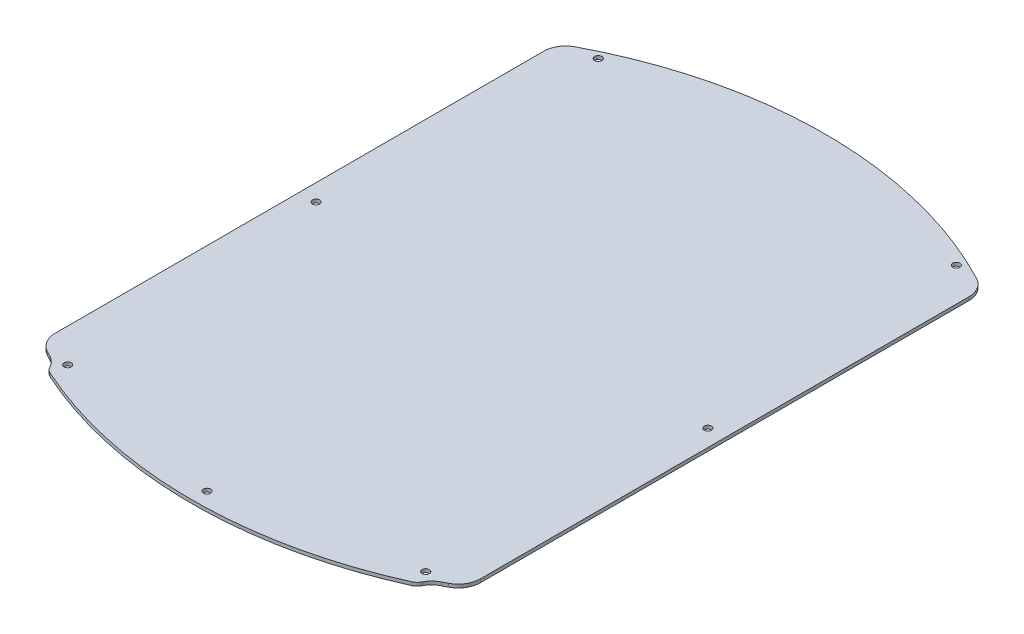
ISO-10303-21;
HEADER;
FILE_DESCRIPTION(('STEP AP214'),'2;1');
FILE_NAME('part.step','',(''),(''),'','','');
FILE_SCHEMA(('AUTOMOTIVE_DESIGN { 1 0 10303 214 1 1 1 1 }'));
ENDSEC;
DATA;
#1=APPLICATION_CONTEXT('core data for automotive mechanical design processes');
#2=APPLICATION_PROTOCOL_DEFINITION('international standard','automotive_design',2000,#1);
#3=PRODUCT_CONTEXT('',#1,'mechanical');
#4=PRODUCT('Part','Part','',(#3));
#5=PRODUCT_RELATED_PRODUCT_CATEGORY('part','',(#4));
#6=PRODUCT_DEFINITION_FORMATION('','',#4);
#7=PRODUCT_DEFINITION_CONTEXT('part definition',#1,'design');
#8=PRODUCT_DEFINITION('design','',#6,#7);
#9=PRODUCT_DEFINITION_SHAPE('','',#8);
#10=(LENGTH_UNIT() NAMED_UNIT(*) SI_UNIT(.MILLI.,.METRE.));
#11=(NAMED_UNIT(*) PLANE_ANGLE_UNIT() SI_UNIT($,.RADIAN.));
#12=(NAMED_UNIT(*) SI_UNIT($,.STERADIAN.) SOLID_ANGLE_UNIT());
#13=UNCERTAINTY_MEASURE_WITH_UNIT(LENGTH_MEASURE(1.E-05),#10,'distance_accuracy_value','');
#14=(GEOMETRIC_REPRESENTATION_CONTEXT(3) GLOBAL_UNCERTAINTY_ASSIGNED_CONTEXT((#13)) GLOBAL_UNIT_ASSIGNED_CONTEXT((#10,
#11,#12)) REPRESENTATION_CONTEXT('',''));
#15=CARTESIAN_POINT('',(0.,0.,0.));
#16=DIRECTION('',(0.,0.,1.));
#17=DIRECTION('',(1.,0.,0.));
#18=AXIS2_PLACEMENT_3D('',#15,#16,#17);
#19=CARTESIAN_POINT('',(0.,-1.5,-52.9999999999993));
#20=DIRECTION('',(0.,1.,0.));
#21=DIRECTION('',(0.,0.,1.));
#22=AXIS2_PLACEMENT_3D('',#19,#20,#21);
#23=CYLINDRICAL_SURFACE('',#22,193.);
#24=CARTESIAN_POINT('',(0.,-1.5,-52.9999999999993));
#25=DIRECTION('',(0.,1.,0.));
#26=DIRECTION('',(0.,0.,1.));
#27=AXIS2_PLACEMENT_3D('',#24,#25,#26);
#28=CIRCLE('',#27,193.);
#29=CARTESIAN_POINT('',(-89.6448087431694,-1.5,117.917548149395));
#30=VERTEX_POINT('',#29);
#31=CARTESIAN_POINT('',(-87.4520577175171,-1.5,119.049811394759));
#32=VERTEX_POINT('',#31);
#33=EDGE_CURVE('E180',#30,#32,#28,.T.);
#34=ORIENTED_EDGE('',*,*,#33,.T.);
#35=DIRECTION('',(0.,1.,0.));
#36=VECTOR('',#35,1.);
#37=CARTESIAN_POINT('',(-87.4520577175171,-1.5,119.049811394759));
#38=LINE('',#37,#36);
#39=CARTESIAN_POINT('',(-87.4520577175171,0.,119.049811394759));
#40=VERTEX_POINT('',#39);
#41=EDGE_CURVE('E206',#32,#40,#38,.T.);
#42=ORIENTED_EDGE('',*,*,#41,.T.);
#43=CARTESIAN_POINT('',(0.,0.,-52.9999999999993));
#44=DIRECTION('',(0.,1.,0.));
#45=DIRECTION('',(0.,0.,1.));
#46=AXIS2_PLACEMENT_3D('',#43,#44,#45);
#47=CIRCLE('',#46,193.);
#48=CARTESIAN_POINT('',(-89.6448087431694,0.,117.917548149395));
#49=VERTEX_POINT('',#48);
#50=EDGE_CURVE('E267',#49,#40,#47,.T.);
#51=ORIENTED_EDGE('',*,*,#50,.F.);
#52=DIRECTION('',(0.,1.,0.));
#53=VECTOR('',#52,1.);
#54=CARTESIAN_POINT('',(-89.6448087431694,-1.5,117.917548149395));
#55=LINE('',#54,#53);
#56=EDGE_CURVE('E204',#49,#30,#55,.F.);
#57=ORIENTED_EDGE('',*,*,#56,.T.);
#58=EDGE_LOOP('',(#34,#42,#51,#57));
#59=FACE_BOUND('',#58,.T.);
#60=ADVANCED_FACE('F43',(#59),#23,.T.);
#61=CARTESIAN_POINT('',(0.,-1.5,53.0000000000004));
#62=DIRECTION('',(0.,1.,0.));
#63=DIRECTION('',(0.,0.,1.));
#64=AXIS2_PLACEMENT_3D('',#61,#62,#63);
#65=CYLINDRICAL_SURFACE('',#64,193.);
#66=CARTESIAN_POINT('',(0.,-1.5,53.0000000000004));
#67=DIRECTION('',(0.,1.,0.));
#68=DIRECTION('',(0.,0.,-1.));
#69=AXIS2_PLACEMENT_3D('',#66,#67,#68);
#70=CIRCLE('',#69,193.);
#71=CARTESIAN_POINT('',(89.6448087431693,-1.5,-117.917548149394));
#72=VERTEX_POINT('',#71);
#73=CARTESIAN_POINT('',(-89.6448087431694,-1.5,-117.917548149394));
#74=VERTEX_POINT('',#73);
#75=EDGE_CURVE('E262',#72,#74,#70,.T.);
#76=ORIENTED_EDGE('',*,*,#75,.T.);
#77=DIRECTION('',(0.,1.,0.));
#78=VECTOR('',#77,1.);
#79=CARTESIAN_POINT('',(-89.6448087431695,-1.5,-117.917548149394));
#80=LINE('',#79,#78);
#81=CARTESIAN_POINT('',(-89.6448087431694,0.,-117.917548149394));
#82=VERTEX_POINT('',#81);
#83=EDGE_CURVE('E168',#74,#82,#80,.T.);
#84=ORIENTED_EDGE('',*,*,#83,.T.);
#85=CARTESIAN_POINT('',(0.,0.,53.0000000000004));
#86=DIRECTION('',(0.,1.,0.));
#87=DIRECTION('',(0.,0.,-1.));
#88=AXIS2_PLACEMENT_3D('',#85,#86,#87);
#89=CIRCLE('',#88,193.);
#90=CARTESIAN_POINT('',(89.6448087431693,0.,-117.917548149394));
#91=VERTEX_POINT('',#90);
#92=EDGE_CURVE('E151',#91,#82,#89,.T.);
#93=ORIENTED_EDGE('',*,*,#92,.F.);
#94=DIRECTION('',(0.,1.,0.));
#95=VECTOR('',#94,1.);
#96=CARTESIAN_POINT('',(89.6448087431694,-1.5,-117.917548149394));
#97=LINE('',#96,#95);
#98=EDGE_CURVE('E165',#91,#72,#97,.F.);
#99=ORIENTED_EDGE('',*,*,#98,.T.);
#100=EDGE_LOOP('',(#76,#84,#93,#99));
#101=FACE_BOUND('',#100,.T.);
#102=ADVANCED_FACE('F164',(#101),#65,.T.);
#103=CARTESIAN_POINT('',(95.,-1.5,115.));
#104=DIRECTION('',(1.,0.,0.));
#105=DIRECTION('',(0.,0.,-1.));
#106=AXIS2_PLACEMENT_3D('',#103,#104,#105);
#107=PLANE('',#106);
#108=DIRECTION('',(0.,0.,-1.));
#109=VECTOR('',#108,1.);
#110=CARTESIAN_POINT('',(95.,-1.5,115.));
#111=LINE('',#110,#109);
#112=CARTESIAN_POINT('',(95.,-1.5,109.061716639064));
#113=VERTEX_POINT('',#112);
#114=CARTESIAN_POINT('',(95.,-1.5,-109.061716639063));
#115=VERTEX_POINT('',#114);
#116=EDGE_CURVE('E175',#113,#115,#111,.T.);
#117=ORIENTED_EDGE('',*,*,#116,.T.);
#118=DIRECTION('',(0.,1.,0.));
#119=VECTOR('',#118,1.);
#120=CARTESIAN_POINT('',(95.,-1.5,-109.061716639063));
#121=LINE('',#120,#119);
#122=CARTESIAN_POINT('',(95.,0.,-109.061716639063));
#123=VERTEX_POINT('',#122);
#124=EDGE_CURVE('E202',#115,#123,#121,.T.);
#125=ORIENTED_EDGE('',*,*,#124,.T.);
#126=DIRECTION('',(0.,0.,-1.));
#127=VECTOR('',#126,1.);
#128=CARTESIAN_POINT('',(95.,0.,115.));
#129=LINE('',#128,#127);
#130=CARTESIAN_POINT('',(95.,0.,109.061716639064));
#131=VERTEX_POINT('',#130);
#132=EDGE_CURVE('E153',#131,#123,#129,.T.);
#133=ORIENTED_EDGE('',*,*,#132,.F.);
#134=DIRECTION('',(0.,1.,0.));
#135=VECTOR('',#134,1.);
#136=CARTESIAN_POINT('',(95.,-1.5,109.061716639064));
#137=LINE('',#136,#135);
#138=EDGE_CURVE('E200',#131,#113,#137,.F.);
#139=ORIENTED_EDGE('',*,*,#138,.T.);
#140=EDGE_LOOP('',(#117,#125,#133,#139));
#141=FACE_BOUND('',#140,.T.);
#142=ADVANCED_FACE('F346',(#141),#107,.T.);
#143=CARTESIAN_POINT('',(87.4520577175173,0.,119.049811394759));
#144=VERTEX_POINT('',#143);
#145=CARTESIAN_POINT('',(89.6448087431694,0.,117.917548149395));
#146=VERTEX_POINT('',#145);
#147=EDGE_CURVE('E255',#144,#146,#47,.T.);
#148=ORIENTED_EDGE('',*,*,#147,.F.);
#149=DIRECTION('',(0.,1.,0.));
#150=VECTOR('',#149,1.);
#151=CARTESIAN_POINT('',(87.4520577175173,-1.5,119.049811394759));
#152=LINE('',#151,#150);
#153=CARTESIAN_POINT('',(87.4520577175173,-1.5,119.049811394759));
#154=VERTEX_POINT('',#153);
#155=EDGE_CURVE('E212',#144,#154,#152,.F.);
#156=ORIENTED_EDGE('',*,*,#155,.T.);
#157=CARTESIAN_POINT('',(89.6448087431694,-1.5,117.917548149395));
#158=VERTEX_POINT('',#157);
#159=EDGE_CURVE('E253',#154,#158,#28,.T.);
#160=ORIENTED_EDGE('',*,*,#159,.T.);
#161=DIRECTION('',(0.,1.,0.));
#162=VECTOR('',#161,1.);
#163=CARTESIAN_POINT('',(89.6448087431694,-1.5,117.917548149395));
#164=LINE('',#163,#162);
#165=EDGE_CURVE('E209',#158,#146,#164,.T.);
#166=ORIENTED_EDGE('',*,*,#165,.T.);
#167=EDGE_LOOP('',(#148,#156,#160,#166));
#168=FACE_BOUND('',#167,.T.);
#169=ADVANCED_FACE('F252',(#168),#23,.T.);
#170=CARTESIAN_POINT('',(-95.,-1.5,115.));
#171=DIRECTION('',(-1.,0.,0.));
#172=DIRECTION('',(0.,0.,1.));
#173=AXIS2_PLACEMENT_3D('',#170,#171,#172);
#174=PLANE('',#173);
#175=DIRECTION('',(0.,0.,1.));
#176=VECTOR('',#175,1.);
#177=CARTESIAN_POINT('',(-95.,0.,115.));
#178=LINE('',#177,#176);
#179=CARTESIAN_POINT('',(-95.,0.,-109.061716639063));
#180=VERTEX_POINT('',#179);
#181=CARTESIAN_POINT('',(-95.,0.,109.061716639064));
#182=VERTEX_POINT('',#181);
#183=EDGE_CURVE('E169',#180,#182,#178,.T.);
#184=ORIENTED_EDGE('',*,*,#183,.F.);
#185=DIRECTION('',(0.,1.,0.));
#186=VECTOR('',#185,1.);
#187=CARTESIAN_POINT('',(-95.,-1.5,-109.061716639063));
#188=LINE('',#187,#186);
#189=CARTESIAN_POINT('',(-95.,-1.5,-109.061716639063));
#190=VERTEX_POINT('',#189);
#191=EDGE_CURVE('E191',#180,#190,#188,.F.);
#192=ORIENTED_EDGE('',*,*,#191,.T.);
#193=DIRECTION('',(0.,0.,1.));
#194=VECTOR('',#193,1.);
#195=CARTESIAN_POINT('',(-95.,-1.5,115.));
#196=LINE('',#195,#194);
#197=CARTESIAN_POINT('',(-95.,-1.5,109.061716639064));
#198=VERTEX_POINT('',#197);
#199=EDGE_CURVE('E258',#190,#198,#196,.T.);
#200=ORIENTED_EDGE('',*,*,#199,.T.);
#201=DIRECTION('',(0.,1.,0.));
#202=VECTOR('',#201,1.);
#203=CARTESIAN_POINT('',(-95.,-1.5,109.061716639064));
#204=LINE('',#203,#202);
#205=EDGE_CURVE('E188',#198,#182,#204,.T.);
#206=ORIENTED_EDGE('',*,*,#205,.T.);
#207=EDGE_LOOP('',(#184,#192,#200,#206));
#208=FACE_BOUND('',#207,.T.);
#209=ADVANCED_FACE('F351',(#208),#174,.T.);
#210=CARTESIAN_POINT('',(0.,-1.5,53.0000000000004));
#211=DIRECTION('',(0.,-1.,0.));
#212=DIRECTION('',(0.,0.,-1.));
#213=AXIS2_PLACEMENT_3D('',#210,#211,#212);
#214=PLANE('',#213);
#215=CARTESIAN_POINT('',(79.9805060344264,-1.5,118.518748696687));
#216=DIRECTION('',(0.,1.,0.));
#217=DIRECTION('',(0.,0.,1.));
#218=AXIS2_PLACEMENT_3D('',#215,#216,#217);
#219=CIRCLE('',#218,1.60000000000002);
#220=CARTESIAN_POINT('',(79.9805060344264,-1.5,120.118748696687));
#221=VERTEX_POINT('',#220);
#222=EDGE_CURVE('E291',#221,#221,#219,.T.);
#223=ORIENTED_EDGE('',*,*,#222,.T.);
#224=EDGE_LOOP('',(#223));
#225=FACE_BOUND('',#224,.T.);
#226=CARTESIAN_POINT('',(0.,-1.5,136.25));
#227=DIRECTION('',(0.,1.,0.));
#228=DIRECTION('',(0.,0.,1.));
#229=AXIS2_PLACEMENT_3D('',#226,#227,#228);
#230=CIRCLE('',#229,1.60000000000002);
#231=CARTESIAN_POINT('',(0.,-1.5,137.85));
#232=VERTEX_POINT('',#231);
#233=EDGE_CURVE('E298',#232,#232,#230,.T.);
#234=ORIENTED_EDGE('',*,*,#233,.T.);
#235=EDGE_LOOP('',(#234));
#236=FACE_BOUND('',#235,.T.);
#237=CARTESIAN_POINT('',(-79.9805060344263,-1.5,118.518748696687));
#238=DIRECTION('',(0.,1.,0.));
#239=DIRECTION('',(0.,0.,1.));
#240=AXIS2_PLACEMENT_3D('',#237,#238,#239);
#241=CIRCLE('',#240,1.60000000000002);
#242=CARTESIAN_POINT('',(-79.9805060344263,-1.5,120.118748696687));
#243=VERTEX_POINT('',#242);
#244=EDGE_CURVE('E279',#243,#243,#241,.T.);
#245=ORIENTED_EDGE('',*,*,#244,.T.);
#246=EDGE_LOOP('',(#245));
#247=FACE_BOUND('',#246,.T.);
#248=CARTESIAN_POINT('',(79.9805060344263,-1.5,-118.518748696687));
#249=DIRECTION('',(0.,1.,0.));
#250=DIRECTION('',(0.,0.,1.));
#251=AXIS2_PLACEMENT_3D('',#248,#249,#250);
#252=CIRCLE('',#251,1.60000000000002);
#253=CARTESIAN_POINT('',(79.9805060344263,-1.5,-116.918748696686));
#254=VERTEX_POINT('',#253);
#255=EDGE_CURVE('E286',#254,#254,#252,.T.);
#256=ORIENTED_EDGE('',*,*,#255,.T.);
#257=EDGE_LOOP('',(#256));
#258=FACE_BOUND('',#257,.T.);
#259=CARTESIAN_POINT('',(87.5000000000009,-1.5,0.));
#260=DIRECTION('',(0.,1.,0.));
#261=DIRECTION('',(0.,0.,1.));
#262=AXIS2_PLACEMENT_3D('',#259,#260,#261);
#263=CIRCLE('',#262,1.60000000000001);
#264=CARTESIAN_POINT('',(87.5000000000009,-1.5,1.60000000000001));
#265=VERTEX_POINT('',#264);
#266=EDGE_CURVE('E309',#265,#265,#263,.T.);
#267=ORIENTED_EDGE('',*,*,#266,.T.);
#268=EDGE_LOOP('',(#267));
#269=FACE_BOUND('',#268,.T.);
#270=CARTESIAN_POINT('',(-87.5000000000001,-1.5,0.));
#271=DIRECTION('',(0.,1.,0.));
#272=DIRECTION('',(0.,0.,1.));
#273=AXIS2_PLACEMENT_3D('',#270,#271,#272);
#274=CIRCLE('',#273,1.60000000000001);
#275=CARTESIAN_POINT('',(-87.5000000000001,-1.5,1.60000000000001));
#276=VERTEX_POINT('',#275);
#277=EDGE_CURVE('E303',#276,#276,#274,.T.);
#278=ORIENTED_EDGE('',*,*,#277,.T.);
#279=EDGE_LOOP('',(#278));
#280=FACE_BOUND('',#279,.T.);
#281=CARTESIAN_POINT('',(-79.9805060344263,-1.5,-118.518748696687));
#282=DIRECTION('',(0.,1.,0.));
#283=DIRECTION('',(0.,0.,1.));
#284=AXIS2_PLACEMENT_3D('',#281,#282,#283);
#285=CIRCLE('',#284,1.60000000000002);
#286=CARTESIAN_POINT('',(-79.9805060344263,-1.5,-116.918748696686));
#287=VERTEX_POINT('',#286);
#288=EDGE_CURVE('E271',#287,#287,#285,.T.);
#289=ORIENTED_EDGE('',*,*,#288,.T.);
#290=EDGE_LOOP('',(#289));
#291=FACE_BOUND('',#290,.T.);
#292=CARTESIAN_POINT('',(91.9832524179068,-1.5,127.964309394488));
#293=DIRECTION('',(0.,-1.,0.));
#294=DIRECTION('',(0.,0.,-1.));
#295=AXIS2_PLACEMENT_3D('',#292,#293,#294);
#296=CIRCLE('',#295,10.);
#297=CARTESIAN_POINT('',(83.1111833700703,-1.5,123.35059171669));
#298=VERTEX_POINT('',#297);
#299=EDGE_CURVE('E221',#154,#298,#296,.F.);
#300=ORIENTED_EDGE('',*,*,#299,.T.);
#301=CARTESIAN_POINT('',(78.6751488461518,-1.5,121.043732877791));
#302=DIRECTION('',(0.,-1.,0.));
#303=DIRECTION('',(0.,0.,-1.));
#304=AXIS2_PLACEMENT_3D('',#301,#302,#303);
#305=CIRCLE('',#304,5.);
#306=CARTESIAN_POINT('',(80.7347077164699,-1.5,125.599851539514));
#307=VERTEX_POINT('',#306);
#308=EDGE_CURVE('E51',#298,#307,#305,.T.);
#309=ORIENTED_EDGE('',*,*,#308,.T.);
#310=CARTESIAN_POINT('',(0.,-1.5,-52.9999999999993));
#311=DIRECTION('',(0.,1.,0.));
#312=DIRECTION('',(0.,0.,1.));
#313=AXIS2_PLACEMENT_3D('',#310,#311,#312);
#314=CIRCLE('',#313,196.);
#315=CARTESIAN_POINT('',(-80.7347077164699,-1.5,125.599851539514));
#316=VERTEX_POINT('',#315);
#317=EDGE_CURVE('E170',#316,#307,#314,.T.);
#318=ORIENTED_EDGE('',*,*,#317,.F.);
#319=CARTESIAN_POINT('',(-78.6751488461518,-1.5,121.043732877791));
#320=DIRECTION('',(0.,-1.,0.));
#321=DIRECTION('',(0.,0.,-1.));
#322=AXIS2_PLACEMENT_3D('',#319,#320,#321);
#323=CIRCLE('',#322,5.);
#324=CARTESIAN_POINT('',(-83.1111833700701,-1.5,123.35059171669));
#325=VERTEX_POINT('',#324);
#326=EDGE_CURVE('E58',#316,#325,#323,.T.);
#327=ORIENTED_EDGE('',*,*,#326,.T.);
#328=CARTESIAN_POINT('',(-91.9832524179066,-1.5,127.964309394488));
#329=DIRECTION('',(0.,-1.,0.));
#330=DIRECTION('',(0.,0.,-1.));
#331=AXIS2_PLACEMENT_3D('',#328,#329,#330);
#332=CIRCLE('',#331,10.);
#333=EDGE_CURVE('E217',#325,#32,#332,.F.);
#334=ORIENTED_EDGE('',*,*,#333,.T.);
#335=ORIENTED_EDGE('',*,*,#33,.F.);
#336=CARTESIAN_POINT('',(-85.,-1.5,109.061716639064));
#337=DIRECTION('',(0.,-1.,0.));
#338=DIRECTION('',(0.,0.,-1.));
#339=AXIS2_PLACEMENT_3D('',#336,#337,#338);
#340=CIRCLE('',#339,10.);
#341=EDGE_CURVE('E195',#30,#198,#340,.T.);
#342=ORIENTED_EDGE('',*,*,#341,.T.);
#343=ORIENTED_EDGE('',*,*,#199,.F.);
#344=CARTESIAN_POINT('',(-85.,-1.5,-109.061716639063));
#345=DIRECTION('',(0.,-1.,0.));
#346=DIRECTION('',(0.,0.,-1.));
#347=AXIS2_PLACEMENT_3D('',#344,#345,#346);
#348=CIRCLE('',#347,10.);
#349=EDGE_CURVE('E198',#190,#74,#348,.T.);
#350=ORIENTED_EDGE('',*,*,#349,.T.);
#351=ORIENTED_EDGE('',*,*,#75,.F.);
#352=CARTESIAN_POINT('',(85.,-1.5,-109.061716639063));
#353=DIRECTION('',(0.,-1.,0.));
#354=DIRECTION('',(0.,0.,-1.));
#355=AXIS2_PLACEMENT_3D('',#352,#353,#354);
#356=CIRCLE('',#355,10.);
#357=EDGE_CURVE('E174',#72,#115,#356,.T.);
#358=ORIENTED_EDGE('',*,*,#357,.T.);
#359=ORIENTED_EDGE('',*,*,#116,.F.);
#360=CARTESIAN_POINT('',(85.,-1.5,109.061716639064));
#361=DIRECTION('',(0.,-1.,0.));
#362=DIRECTION('',(0.,0.,-1.));
#363=AXIS2_PLACEMENT_3D('',#360,#361,#362);
#364=CIRCLE('',#363,10.);
#365=EDGE_CURVE('E193',#113,#158,#364,.T.);
#366=ORIENTED_EDGE('',*,*,#365,.T.);
#367=ORIENTED_EDGE('',*,*,#159,.F.);
#368=EDGE_LOOP('',(#300,#309,#318,#327,#334,#335,#342,#343,#350,#351,#358,#359,#366,#367));
#369=FACE_BOUND('',#368,.T.);
#370=ADVANCED_FACE('F235',(#225,#236,#247,#258,#269,#280,#291,#369),#214,.T.);
#371=CARTESIAN_POINT('',(0.,0.,53.0000000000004));
#372=DIRECTION('',(0.,-1.,0.));
#373=DIRECTION('',(0.,0.,-1.));
#374=AXIS2_PLACEMENT_3D('',#371,#372,#373);
#375=PLANE('',#374);
#376=CARTESIAN_POINT('',(79.9805060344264,0.,118.518748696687));
#377=DIRECTION('',(0.,1.,0.));
#378=DIRECTION('',(0.,0.,1.));
#379=AXIS2_PLACEMENT_3D('',#376,#377,#378);
#380=CIRCLE('',#379,1.60000000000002);
#381=CARTESIAN_POINT('',(79.9805060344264,0.,120.118748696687));
#382=VERTEX_POINT('',#381);
#383=EDGE_CURVE('E294',#382,#382,#380,.T.);
#384=ORIENTED_EDGE('',*,*,#383,.F.);
#385=EDGE_LOOP('',(#384));
#386=FACE_BOUND('',#385,.T.);
#387=CARTESIAN_POINT('',(0.,0.,136.25));
#388=DIRECTION('',(0.,1.,0.));
#389=DIRECTION('',(0.,0.,1.));
#390=AXIS2_PLACEMENT_3D('',#387,#388,#389);
#391=CIRCLE('',#390,1.60000000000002);
#392=CARTESIAN_POINT('',(0.,0.,137.85));
#393=VERTEX_POINT('',#392);
#394=EDGE_CURVE('E283',#393,#393,#391,.T.);
#395=ORIENTED_EDGE('',*,*,#394,.F.);
#396=EDGE_LOOP('',(#395));
#397=FACE_BOUND('',#396,.T.);
#398=CARTESIAN_POINT('',(-79.9805060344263,0.,118.518748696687));
#399=DIRECTION('',(0.,1.,0.));
#400=DIRECTION('',(0.,0.,1.));
#401=AXIS2_PLACEMENT_3D('',#398,#399,#400);
#402=CIRCLE('',#401,1.60000000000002);
#403=CARTESIAN_POINT('',(-79.9805060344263,0.,120.118748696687));
#404=VERTEX_POINT('',#403);
#405=EDGE_CURVE('E282',#404,#404,#402,.T.);
#406=ORIENTED_EDGE('',*,*,#405,.F.);
#407=EDGE_LOOP('',(#406));
#408=FACE_BOUND('',#407,.T.);
#409=CARTESIAN_POINT('',(79.9805060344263,0.,-118.518748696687));
#410=DIRECTION('',(0.,1.,0.));
#411=DIRECTION('',(0.,0.,1.));
#412=AXIS2_PLACEMENT_3D('',#409,#410,#411);
#413=CIRCLE('',#412,1.60000000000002);
#414=CARTESIAN_POINT('',(79.9805060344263,0.,-116.918748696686));
#415=VERTEX_POINT('',#414);
#416=EDGE_CURVE('E276',#415,#415,#413,.T.);
#417=ORIENTED_EDGE('',*,*,#416,.F.);
#418=EDGE_LOOP('',(#417));
#419=FACE_BOUND('',#418,.T.);
#420=CARTESIAN_POINT('',(87.5000000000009,0.,0.));
#421=DIRECTION('',(0.,1.,0.));
#422=DIRECTION('',(0.,0.,1.));
#423=AXIS2_PLACEMENT_3D('',#420,#421,#422);
#424=CIRCLE('',#423,1.60000000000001);
#425=CARTESIAN_POINT('',(87.5000000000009,0.,1.60000000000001));
#426=VERTEX_POINT('',#425);
#427=EDGE_CURVE('E295',#426,#426,#424,.T.);
#428=ORIENTED_EDGE('',*,*,#427,.F.);
#429=EDGE_LOOP('',(#428));
#430=FACE_BOUND('',#429,.T.);
#431=CARTESIAN_POINT('',(-87.5000000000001,0.,0.));
#432=DIRECTION('',(0.,1.,0.));
#433=DIRECTION('',(0.,0.,1.));
#434=AXIS2_PLACEMENT_3D('',#431,#432,#433);
#435=CIRCLE('',#434,1.60000000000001);
#436=CARTESIAN_POINT('',(-87.5000000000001,0.,1.60000000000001));
#437=VERTEX_POINT('',#436);
#438=EDGE_CURVE('E306',#437,#437,#435,.T.);
#439=ORIENTED_EDGE('',*,*,#438,.F.);
#440=EDGE_LOOP('',(#439));
#441=FACE_BOUND('',#440,.T.);
#442=CARTESIAN_POINT('',(-79.9805060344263,0.,-118.518748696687));
#443=DIRECTION('',(0.,1.,0.));
#444=DIRECTION('',(0.,0.,1.));
#445=AXIS2_PLACEMENT_3D('',#442,#443,#444);
#446=CIRCLE('',#445,1.60000000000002);
#447=CARTESIAN_POINT('',(-79.9805060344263,0.,-116.918748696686));
#448=VERTEX_POINT('',#447);
#449=EDGE_CURVE('E273',#448,#448,#446,.T.);
#450=ORIENTED_EDGE('',*,*,#449,.F.);
#451=EDGE_LOOP('',(#450));
#452=FACE_BOUND('',#451,.T.);
#453=CARTESIAN_POINT('',(0.,0.,-52.9999999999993));
#454=DIRECTION('',(0.,1.,0.));
#455=DIRECTION('',(0.,0.,1.));
#456=AXIS2_PLACEMENT_3D('',#453,#454,#455);
#457=CIRCLE('',#456,196.);
#458=CARTESIAN_POINT('',(-80.7347077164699,0.,125.599851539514));
#459=VERTEX_POINT('',#458);
#460=CARTESIAN_POINT('',(80.7347077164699,0.,125.599851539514));
#461=VERTEX_POINT('',#460);
#462=EDGE_CURVE('E243',#459,#461,#457,.T.);
#463=ORIENTED_EDGE('',*,*,#462,.T.);
#464=CARTESIAN_POINT('',(78.6751488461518,0.,121.043732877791));
#465=DIRECTION('',(0.,-1.,0.));
#466=DIRECTION('',(0.,0.,-1.));
#467=AXIS2_PLACEMENT_3D('',#464,#465,#466);
#468=CIRCLE('',#467,5.);
#469=CARTESIAN_POINT('',(83.1111833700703,0.,123.35059171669));
#470=VERTEX_POINT('',#469);
#471=EDGE_CURVE('E230',#461,#470,#468,.F.);
#472=ORIENTED_EDGE('',*,*,#471,.T.);
#473=CARTESIAN_POINT('',(91.9832524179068,0.,127.964309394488));
#474=DIRECTION('',(0.,-1.,0.));
#475=DIRECTION('',(0.,0.,-1.));
#476=AXIS2_PLACEMENT_3D('',#473,#474,#475);
#477=CIRCLE('',#476,10.);
#478=EDGE_CURVE('E219',#470,#144,#477,.T.);
#479=ORIENTED_EDGE('',*,*,#478,.T.);
#480=ORIENTED_EDGE('',*,*,#147,.T.);
#481=CARTESIAN_POINT('',(85.,0.,109.061716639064));
#482=DIRECTION('',(0.,-1.,0.));
#483=DIRECTION('',(0.,0.,-1.));
#484=AXIS2_PLACEMENT_3D('',#481,#482,#483);
#485=CIRCLE('',#484,10.);
#486=EDGE_CURVE('E177',#146,#131,#485,.F.);
#487=ORIENTED_EDGE('',*,*,#486,.T.);
#488=ORIENTED_EDGE('',*,*,#132,.T.);
#489=CARTESIAN_POINT('',(85.,0.,-109.061716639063));
#490=DIRECTION('',(0.,-1.,0.));
#491=DIRECTION('',(0.,0.,-1.));
#492=AXIS2_PLACEMENT_3D('',#489,#490,#491);
#493=CIRCLE('',#492,10.);
#494=EDGE_CURVE('E147',#123,#91,#493,.F.);
#495=ORIENTED_EDGE('',*,*,#494,.T.);
#496=ORIENTED_EDGE('',*,*,#92,.T.);
#497=CARTESIAN_POINT('',(-85.,0.,-109.061716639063));
#498=DIRECTION('',(0.,-1.,0.));
#499=DIRECTION('',(0.,0.,-1.));
#500=AXIS2_PLACEMENT_3D('',#497,#498,#499);
#501=CIRCLE('',#500,10.);
#502=EDGE_CURVE('E158',#82,#180,#501,.F.);
#503=ORIENTED_EDGE('',*,*,#502,.T.);
#504=ORIENTED_EDGE('',*,*,#183,.T.);
#505=CARTESIAN_POINT('',(-85.,0.,109.061716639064));
#506=DIRECTION('',(0.,-1.,0.));
#507=DIRECTION('',(0.,0.,-1.));
#508=AXIS2_PLACEMENT_3D('',#505,#506,#507);
#509=CIRCLE('',#508,10.);
#510=EDGE_CURVE('E159',#182,#49,#509,.F.);
#511=ORIENTED_EDGE('',*,*,#510,.T.);
#512=ORIENTED_EDGE('',*,*,#50,.T.);
#513=CARTESIAN_POINT('',(-91.9832524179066,0.,127.964309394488));
#514=DIRECTION('',(0.,-1.,0.));
#515=DIRECTION('',(0.,0.,-1.));
#516=AXIS2_PLACEMENT_3D('',#513,#514,#515);
#517=CIRCLE('',#516,10.);
#518=CARTESIAN_POINT('',(-83.1111833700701,0.,123.35059171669));
#519=VERTEX_POINT('',#518);
#520=EDGE_CURVE('E214',#40,#519,#517,.T.);
#521=ORIENTED_EDGE('',*,*,#520,.T.);
#522=CARTESIAN_POINT('',(-78.6751488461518,0.,121.043732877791));
#523=DIRECTION('',(0.,-1.,0.));
#524=DIRECTION('',(0.,0.,-1.));
#525=AXIS2_PLACEMENT_3D('',#522,#523,#524);
#526=CIRCLE('',#525,5.);
#527=EDGE_CURVE('E228',#519,#459,#526,.F.);
#528=ORIENTED_EDGE('',*,*,#527,.T.);
#529=EDGE_LOOP('',(#463,#472,#479,#480,#487,#488,#495,#496,#503,#504,#511,#512,#521,#528));
#530=FACE_BOUND('',#529,.T.);
#531=ADVANCED_FACE('F150',(#386,#397,#408,#419,#430,#441,#452,#530),#375,.F.);
#532=CARTESIAN_POINT('',(0.,-1.5,-52.9999999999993));
#533=DIRECTION('',(0.,1.,0.));
#534=DIRECTION('',(0.,0.,1.));
#535=AXIS2_PLACEMENT_3D('',#532,#533,#534);
#536=CYLINDRICAL_SURFACE('',#535,196.);
#537=ORIENTED_EDGE('',*,*,#317,.T.);
#538=DIRECTION('',(0.,1.,0.));
#539=VECTOR('',#538,1.);
#540=CARTESIAN_POINT('',(80.7347077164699,-1.5,125.599851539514));
#541=LINE('',#540,#539);
#542=EDGE_CURVE('E225',#307,#461,#541,.T.);
#543=ORIENTED_EDGE('',*,*,#542,.T.);
#544=ORIENTED_EDGE('',*,*,#462,.F.);
#545=DIRECTION('',(0.,1.,0.));
#546=VECTOR('',#545,1.);
#547=CARTESIAN_POINT('',(-80.7347077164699,-1.5,125.599851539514));
#548=LINE('',#547,#546);
#549=EDGE_CURVE('E223',#459,#316,#548,.F.);
#550=ORIENTED_EDGE('',*,*,#549,.T.);
#551=EDGE_LOOP('',(#537,#543,#544,#550));
#552=FACE_BOUND('',#551,.T.);
#553=ADVANCED_FACE('F240',(#552),#536,.T.);
#554=CARTESIAN_POINT('',(-85.,-1.5,-109.061716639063));
#555=DIRECTION('',(0.,1.,0.));
#556=DIRECTION('',(0.,0.,1.));
#557=AXIS2_PLACEMENT_3D('',#554,#555,#556);
#558=CYLINDRICAL_SURFACE('',#557,10.);
#559=ORIENTED_EDGE('',*,*,#349,.F.);
#560=ORIENTED_EDGE('',*,*,#191,.F.);
#561=ORIENTED_EDGE('',*,*,#502,.F.);
#562=ORIENTED_EDGE('',*,*,#83,.F.);
#563=EDGE_LOOP('',(#559,#560,#561,#562));
#564=FACE_BOUND('',#563,.T.);
#565=ADVANCED_FACE('F364',(#564),#558,.T.);
#566=CARTESIAN_POINT('',(85.,-1.5,-109.061716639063));
#567=DIRECTION('',(0.,1.,0.));
#568=DIRECTION('',(0.,0.,1.));
#569=AXIS2_PLACEMENT_3D('',#566,#567,#568);
#570=CYLINDRICAL_SURFACE('',#569,10.);
#571=ORIENTED_EDGE('',*,*,#357,.F.);
#572=ORIENTED_EDGE('',*,*,#98,.F.);
#573=ORIENTED_EDGE('',*,*,#494,.F.);
#574=ORIENTED_EDGE('',*,*,#124,.F.);
#575=EDGE_LOOP('',(#571,#572,#573,#574));
#576=FACE_BOUND('',#575,.T.);
#577=ADVANCED_FACE('F173',(#576),#570,.T.);
#578=CARTESIAN_POINT('',(-91.9832524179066,-1.5,127.964309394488));
#579=DIRECTION('',(0.,-1.,0.));
#580=DIRECTION('',(0.,0.,-1.));
#581=AXIS2_PLACEMENT_3D('',#578,#579,#580);
#582=CYLINDRICAL_SURFACE('',#581,10.);
#583=ORIENTED_EDGE('',*,*,#333,.F.);
#584=DIRECTION('',(0.,-1.,0.));
#585=VECTOR('',#584,1.);
#586=CARTESIAN_POINT('',(-83.1111833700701,-1.5,123.35059171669));
#587=LINE('',#586,#585);
#588=EDGE_CURVE('E11',#325,#519,#587,.F.);
#589=ORIENTED_EDGE('',*,*,#588,.T.);
#590=ORIENTED_EDGE('',*,*,#520,.F.);
#591=ORIENTED_EDGE('',*,*,#41,.F.);
#592=EDGE_LOOP('',(#583,#589,#590,#591));
#593=FACE_BOUND('',#592,.T.);
#594=ADVANCED_FACE('F373',(#593),#582,.F.);
#595=CARTESIAN_POINT('',(91.9832524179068,-1.5,127.964309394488));
#596=DIRECTION('',(0.,-1.,0.));
#597=DIRECTION('',(0.,0.,-1.));
#598=AXIS2_PLACEMENT_3D('',#595,#596,#597);
#599=CYLINDRICAL_SURFACE('',#598,10.);
#600=ORIENTED_EDGE('',*,*,#478,.F.);
#601=DIRECTION('',(0.,-1.,0.));
#602=VECTOR('',#601,1.);
#603=CARTESIAN_POINT('',(83.1111833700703,-1.5,123.35059171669));
#604=LINE('',#603,#602);
#605=EDGE_CURVE('E66',#470,#298,#604,.T.);
#606=ORIENTED_EDGE('',*,*,#605,.T.);
#607=ORIENTED_EDGE('',*,*,#299,.F.);
#608=ORIENTED_EDGE('',*,*,#155,.F.);
#609=EDGE_LOOP('',(#600,#606,#607,#608));
#610=FACE_BOUND('',#609,.T.);
#611=ADVANCED_FACE('F249',(#610),#599,.F.);
#612=CARTESIAN_POINT('',(-85.,-1.5,109.061716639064));
#613=DIRECTION('',(0.,1.,0.));
#614=DIRECTION('',(0.,0.,1.));
#615=AXIS2_PLACEMENT_3D('',#612,#613,#614);
#616=CYLINDRICAL_SURFACE('',#615,10.);
#617=ORIENTED_EDGE('',*,*,#341,.F.);
#618=ORIENTED_EDGE('',*,*,#56,.F.);
#619=ORIENTED_EDGE('',*,*,#510,.F.);
#620=ORIENTED_EDGE('',*,*,#205,.F.);
#621=EDGE_LOOP('',(#617,#618,#619,#620));
#622=FACE_BOUND('',#621,.T.);
#623=ADVANCED_FACE('F382',(#622),#616,.T.);
#624=CARTESIAN_POINT('',(85.,-1.5,109.061716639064));
#625=DIRECTION('',(0.,1.,0.));
#626=DIRECTION('',(0.,0.,1.));
#627=AXIS2_PLACEMENT_3D('',#624,#625,#626);
#628=CYLINDRICAL_SURFACE('',#627,10.);
#629=ORIENTED_EDGE('',*,*,#365,.F.);
#630=ORIENTED_EDGE('',*,*,#138,.F.);
#631=ORIENTED_EDGE('',*,*,#486,.F.);
#632=ORIENTED_EDGE('',*,*,#165,.F.);
#633=EDGE_LOOP('',(#629,#630,#631,#632));
#634=FACE_BOUND('',#633,.T.);
#635=ADVANCED_FACE('F385',(#634),#628,.T.);
#636=CARTESIAN_POINT('',(78.6751488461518,-1.5,121.043732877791));
#637=DIRECTION('',(0.,-1.,0.));
#638=DIRECTION('',(0.,0.,-1.));
#639=AXIS2_PLACEMENT_3D('',#636,#637,#638);
#640=CYLINDRICAL_SURFACE('',#639,5.);
#641=ORIENTED_EDGE('',*,*,#308,.F.);
#642=ORIENTED_EDGE('',*,*,#605,.F.);
#643=ORIENTED_EDGE('',*,*,#471,.F.);
#644=ORIENTED_EDGE('',*,*,#542,.F.);
#645=EDGE_LOOP('',(#641,#642,#643,#644));
#646=FACE_BOUND('',#645,.T.);
#647=ADVANCED_FACE('F245',(#646),#640,.T.);
#648=CARTESIAN_POINT('',(-78.6751488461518,-1.5,121.043732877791));
#649=DIRECTION('',(0.,-1.,0.));
#650=DIRECTION('',(0.,0.,-1.));
#651=AXIS2_PLACEMENT_3D('',#648,#649,#650);
#652=CYLINDRICAL_SURFACE('',#651,5.);
#653=ORIENTED_EDGE('',*,*,#326,.F.);
#654=ORIENTED_EDGE('',*,*,#549,.F.);
#655=ORIENTED_EDGE('',*,*,#527,.F.);
#656=ORIENTED_EDGE('',*,*,#588,.F.);
#657=EDGE_LOOP('',(#653,#654,#655,#656));
#658=FACE_BOUND('',#657,.T.);
#659=ADVANCED_FACE('F45',(#658),#652,.T.);
#660=CARTESIAN_POINT('',(-79.9805060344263,-1.5,-118.518748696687));
#661=DIRECTION('',(0.,1.,0.));
#662=DIRECTION('',(0.,0.,1.));
#663=AXIS2_PLACEMENT_3D('',#660,#661,#662);
#664=CYLINDRICAL_SURFACE('',#663,1.60000000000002);
#665=ORIENTED_EDGE('',*,*,#288,.F.);
#666=EDGE_LOOP('',(#665));
#667=FACE_BOUND('',#666,.T.);
#668=ORIENTED_EDGE('',*,*,#449,.T.);
#669=EDGE_LOOP('',(#668));
#670=FACE_BOUND('',#669,.T.);
#671=ADVANCED_FACE('F325',(#667,#670),#664,.F.);
#672=CARTESIAN_POINT('',(-87.5000000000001,-1.5,0.));
#673=DIRECTION('',(0.,1.,0.));
#674=DIRECTION('',(0.,0.,1.));
#675=AXIS2_PLACEMENT_3D('',#672,#673,#674);
#676=CYLINDRICAL_SURFACE('',#675,1.60000000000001);
#677=ORIENTED_EDGE('',*,*,#277,.F.);
#678=EDGE_LOOP('',(#677));
#679=FACE_BOUND('',#678,.T.);
#680=ORIENTED_EDGE('',*,*,#438,.T.);
#681=EDGE_LOOP('',(#680));
#682=FACE_BOUND('',#681,.T.);
#683=ADVANCED_FACE('F327',(#679,#682),#676,.F.);
#684=CARTESIAN_POINT('',(87.5000000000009,-1.5,0.));
#685=DIRECTION('',(0.,1.,0.));
#686=DIRECTION('',(0.,0.,1.));
#687=AXIS2_PLACEMENT_3D('',#684,#685,#686);
#688=CYLINDRICAL_SURFACE('',#687,1.60000000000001);
#689=ORIENTED_EDGE('',*,*,#266,.F.);
#690=EDGE_LOOP('',(#689));
#691=FACE_BOUND('',#690,.T.);
#692=ORIENTED_EDGE('',*,*,#427,.T.);
#693=EDGE_LOOP('',(#692));
#694=FACE_BOUND('',#693,.T.);
#695=ADVANCED_FACE('F315',(#691,#694),#688,.F.);
#696=CARTESIAN_POINT('',(79.9805060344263,-1.5,-118.518748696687));
#697=DIRECTION('',(0.,1.,0.));
#698=DIRECTION('',(0.,0.,1.));
#699=AXIS2_PLACEMENT_3D('',#696,#697,#698);
#700=CYLINDRICAL_SURFACE('',#699,1.60000000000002);
#701=ORIENTED_EDGE('',*,*,#255,.F.);
#702=EDGE_LOOP('',(#701));
#703=FACE_BOUND('',#702,.T.);
#704=ORIENTED_EDGE('',*,*,#416,.T.);
#705=EDGE_LOOP('',(#704));
#706=FACE_BOUND('',#705,.T.);
#707=ADVANCED_FACE('F437',(#703,#706),#700,.F.);
#708=CARTESIAN_POINT('',(-79.9805060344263,-1.5,118.518748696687));
#709=DIRECTION('',(0.,1.,0.));
#710=DIRECTION('',(0.,0.,1.));
#711=AXIS2_PLACEMENT_3D('',#708,#709,#710);
#712=CYLINDRICAL_SURFACE('',#711,1.60000000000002);
#713=ORIENTED_EDGE('',*,*,#244,.F.);
#714=EDGE_LOOP('',(#713));
#715=FACE_BOUND('',#714,.T.);
#716=ORIENTED_EDGE('',*,*,#405,.T.);
#717=EDGE_LOOP('',(#716));
#718=FACE_BOUND('',#717,.T.);
#719=ADVANCED_FACE('F448',(#715,#718),#712,.F.);
#720=CARTESIAN_POINT('',(0.,-1.5,136.25));
#721=DIRECTION('',(0.,1.,0.));
#722=DIRECTION('',(0.,0.,1.));
#723=AXIS2_PLACEMENT_3D('',#720,#721,#722);
#724=CYLINDRICAL_SURFACE('',#723,1.60000000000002);
#725=ORIENTED_EDGE('',*,*,#233,.F.);
#726=EDGE_LOOP('',(#725));
#727=FACE_BOUND('',#726,.T.);
#728=ORIENTED_EDGE('',*,*,#394,.T.);
#729=EDGE_LOOP('',(#728));
#730=FACE_BOUND('',#729,.T.);
#731=ADVANCED_FACE('F459',(#727,#730),#724,.F.);
#732=CARTESIAN_POINT('',(79.9805060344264,-1.5,118.518748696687));
#733=DIRECTION('',(0.,1.,0.));
#734=DIRECTION('',(0.,0.,1.));
#735=AXIS2_PLACEMENT_3D('',#732,#733,#734);
#736=CYLINDRICAL_SURFACE('',#735,1.60000000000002);
#737=ORIENTED_EDGE('',*,*,#222,.F.);
#738=EDGE_LOOP('',(#737));
#739=FACE_BOUND('',#738,.T.);
#740=ORIENTED_EDGE('',*,*,#383,.T.);
#741=EDGE_LOOP('',(#740));
#742=FACE_BOUND('',#741,.T.);
#743=ADVANCED_FACE('F469',(#739,#742),#736,.F.);
#744=CLOSED_SHELL('',(#60,#102,#142,#169,#209,#370,#531,#553,#565,#577,#594,#611,#623,#635,#647,
#659,#671,#683,#695,#707,#719,#731,#743));
#745=MANIFOLD_SOLID_BREP('B2',#744);
#746=ADVANCED_BREP_SHAPE_REPRESENTATION('',(#18,#745),#14);
#747=SHAPE_DEFINITION_REPRESENTATION(#9,#746);
ENDSEC;
END-ISO-10303-21;
